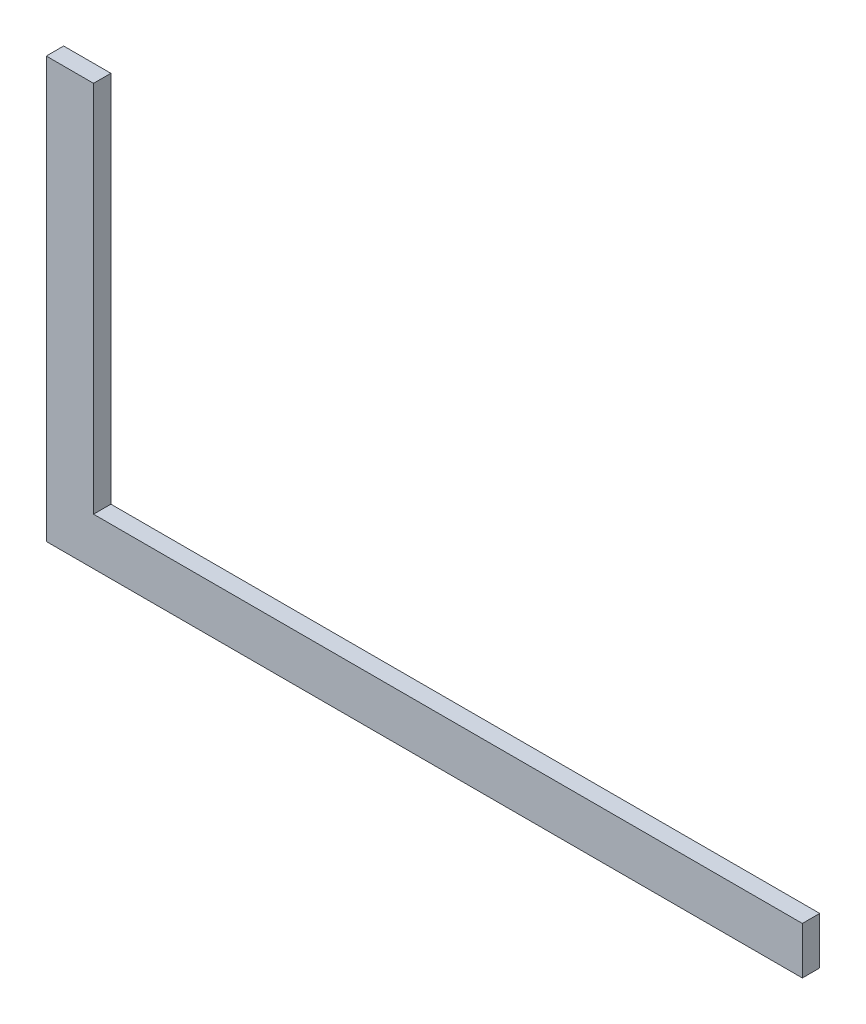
ISO-10303-21;
HEADER;
FILE_DESCRIPTION(('STEP AP214'),'2;1');
FILE_NAME('part.step','',(''),(''),'','','');
FILE_SCHEMA(('AUTOMOTIVE_DESIGN { 1 0 10303 214 1 1 1 1 }'));
ENDSEC;
DATA;
#1=APPLICATION_CONTEXT('core data for automotive mechanical design processes');
#2=APPLICATION_PROTOCOL_DEFINITION('international standard','automotive_design',2000,#1);
#3=PRODUCT_CONTEXT('',#1,'mechanical');
#4=PRODUCT('Part','Part','',(#3));
#5=PRODUCT_RELATED_PRODUCT_CATEGORY('part','',(#4));
#6=PRODUCT_DEFINITION_FORMATION('','',#4);
#7=PRODUCT_DEFINITION_CONTEXT('part definition',#1,'design');
#8=PRODUCT_DEFINITION('design','',#6,#7);
#9=PRODUCT_DEFINITION_SHAPE('','',#8);
#10=(LENGTH_UNIT() NAMED_UNIT(*) SI_UNIT(.MILLI.,.METRE.));
#11=(NAMED_UNIT(*) PLANE_ANGLE_UNIT() SI_UNIT($,.RADIAN.));
#12=(NAMED_UNIT(*) SI_UNIT($,.STERADIAN.) SOLID_ANGLE_UNIT());
#13=UNCERTAINTY_MEASURE_WITH_UNIT(LENGTH_MEASURE(1.E-05),#10,'distance_accuracy_value','');
#14=(GEOMETRIC_REPRESENTATION_CONTEXT(3) GLOBAL_UNCERTAINTY_ASSIGNED_CONTEXT((#13)) GLOBAL_UNIT_ASSIGNED_CONTEXT((#10,
#11,#12)) REPRESENTATION_CONTEXT('',''));
#15=CARTESIAN_POINT('',(0.,0.,0.));
#16=DIRECTION('',(0.,0.,1.));
#17=DIRECTION('',(1.,0.,0.));
#18=AXIS2_PLACEMENT_3D('',#15,#16,#17);
#19=CARTESIAN_POINT('',(0.,0.,1.4));
#20=DIRECTION('',(1.,0.,0.));
#21=DIRECTION('',(0.,0.,-1.));
#22=AXIS2_PLACEMENT_3D('',#19,#20,#21);
#23=PLANE('',#22);
#24=DIRECTION('',(0.,-1.,0.));
#25=VECTOR('',#24,1.);
#26=CARTESIAN_POINT('',(0.,0.,0.));
#27=LINE('',#26,#25);
#28=CARTESIAN_POINT('',(0.,33.8963,0.));
#29=VERTEX_POINT('',#28);
#30=CARTESIAN_POINT('',(0.,0.,0.));
#31=VERTEX_POINT('',#30);
#32=EDGE_CURVE('E117',#29,#31,#27,.T.);
#33=ORIENTED_EDGE('',*,*,#32,.T.);
#34=DIRECTION('',(0.,0.,-1.));
#35=VECTOR('',#34,1.);
#36=CARTESIAN_POINT('',(0.,0.,1.4));
#37=LINE('',#36,#35);
#38=CARTESIAN_POINT('',(0.,0.,1.4));
#39=VERTEX_POINT('',#38);
#40=EDGE_CURVE('E11',#39,#31,#37,.T.);
#41=ORIENTED_EDGE('',*,*,#40,.F.);
#42=DIRECTION('',(0.,-1.,0.));
#43=VECTOR('',#42,1.);
#44=CARTESIAN_POINT('',(0.,0.,1.4));
#45=LINE('',#44,#43);
#46=CARTESIAN_POINT('',(0.,33.8963,1.4));
#47=VERTEX_POINT('',#46);
#48=EDGE_CURVE('E127',#47,#39,#45,.T.);
#49=ORIENTED_EDGE('',*,*,#48,.F.);
#50=DIRECTION('',(0.,0.,-1.));
#51=VECTOR('',#50,1.);
#52=CARTESIAN_POINT('',(0.,33.8963,1.4));
#53=LINE('',#52,#51);
#54=EDGE_CURVE('E113',#47,#29,#53,.T.);
#55=ORIENTED_EDGE('',*,*,#54,.T.);
#56=EDGE_LOOP('',(#33,#41,#49,#55));
#57=FACE_BOUND('',#56,.T.);
#58=ADVANCED_FACE('F33',(#57),#23,.F.);
#59=CARTESIAN_POINT('',(0.,0.,1.4));
#60=DIRECTION('',(0.,1.,0.));
#61=DIRECTION('',(0.,0.,1.));
#62=AXIS2_PLACEMENT_3D('',#59,#60,#61);
#63=PLANE('',#62);
#64=DIRECTION('',(1.,0.,0.));
#65=VECTOR('',#64,1.);
#66=CARTESIAN_POINT('',(0.,0.,0.));
#67=LINE('',#66,#65);
#68=CARTESIAN_POINT('',(60.96,0.,0.));
#69=VERTEX_POINT('',#68);
#70=EDGE_CURVE('E120',#31,#69,#67,.T.);
#71=ORIENTED_EDGE('',*,*,#70,.T.);
#72=DIRECTION('',(0.,0.,-1.));
#73=VECTOR('',#72,1.);
#74=CARTESIAN_POINT('',(60.96,0.,1.4));
#75=LINE('',#74,#73);
#76=CARTESIAN_POINT('',(60.96,0.,1.4));
#77=VERTEX_POINT('',#76);
#78=EDGE_CURVE('E41',#77,#69,#75,.T.);
#79=ORIENTED_EDGE('',*,*,#78,.F.);
#80=DIRECTION('',(1.,0.,0.));
#81=VECTOR('',#80,1.);
#82=CARTESIAN_POINT('',(0.,0.,1.4));
#83=LINE('',#82,#81);
#84=EDGE_CURVE('E86',#39,#77,#83,.T.);
#85=ORIENTED_EDGE('',*,*,#84,.F.);
#86=ORIENTED_EDGE('',*,*,#40,.T.);
#87=EDGE_LOOP('',(#71,#79,#85,#86));
#88=FACE_BOUND('',#87,.T.);
#89=ADVANCED_FACE('F151',(#88),#63,.F.);
#90=CARTESIAN_POINT('',(60.96,0.,1.4));
#91=DIRECTION('',(-1.,0.,0.));
#92=DIRECTION('',(0.,0.,1.));
#93=AXIS2_PLACEMENT_3D('',#90,#91,#92);
#94=PLANE('',#93);
#95=DIRECTION('',(0.,1.,0.));
#96=VECTOR('',#95,1.);
#97=CARTESIAN_POINT('',(60.96,0.,0.));
#98=LINE('',#97,#96);
#99=CARTESIAN_POINT('',(60.96,3.81,0.));
#100=VERTEX_POINT('',#99);
#101=EDGE_CURVE('E122',#69,#100,#98,.T.);
#102=ORIENTED_EDGE('',*,*,#101,.T.);
#103=DIRECTION('',(0.,0.,-1.));
#104=VECTOR('',#103,1.);
#105=CARTESIAN_POINT('',(60.96,3.81,1.4));
#106=LINE('',#105,#104);
#107=CARTESIAN_POINT('',(60.96,3.81,1.4));
#108=VERTEX_POINT('',#107);
#109=EDGE_CURVE('E108',#108,#100,#106,.T.);
#110=ORIENTED_EDGE('',*,*,#109,.F.);
#111=DIRECTION('',(0.,1.,0.));
#112=VECTOR('',#111,1.);
#113=CARTESIAN_POINT('',(60.96,0.,1.4));
#114=LINE('',#113,#112);
#115=EDGE_CURVE('E99',#77,#108,#114,.T.);
#116=ORIENTED_EDGE('',*,*,#115,.F.);
#117=ORIENTED_EDGE('',*,*,#78,.T.);
#118=EDGE_LOOP('',(#102,#110,#116,#117));
#119=FACE_BOUND('',#118,.T.);
#120=ADVANCED_FACE('F133',(#119),#94,.F.);
#121=CARTESIAN_POINT('',(3.81,3.81,1.4));
#122=DIRECTION('',(0.,-1.,0.));
#123=DIRECTION('',(0.,0.,-1.));
#124=AXIS2_PLACEMENT_3D('',#121,#122,#123);
#125=PLANE('',#124);
#126=DIRECTION('',(-1.,0.,0.));
#127=VECTOR('',#126,1.);
#128=CARTESIAN_POINT('',(3.81,3.81,0.));
#129=LINE('',#128,#127);
#130=CARTESIAN_POINT('',(3.81,3.81,0.));
#131=VERTEX_POINT('',#130);
#132=EDGE_CURVE('E107',#100,#131,#129,.T.);
#133=ORIENTED_EDGE('',*,*,#132,.T.);
#134=DIRECTION('',(0.,0.,-1.));
#135=VECTOR('',#134,1.);
#136=CARTESIAN_POINT('',(3.81,3.81,1.4));
#137=LINE('',#136,#135);
#138=CARTESIAN_POINT('',(3.81,3.81,1.4));
#139=VERTEX_POINT('',#138);
#140=EDGE_CURVE('E104',#139,#131,#137,.T.);
#141=ORIENTED_EDGE('',*,*,#140,.F.);
#142=DIRECTION('',(-1.,0.,0.));
#143=VECTOR('',#142,1.);
#144=CARTESIAN_POINT('',(3.81,3.81,1.4));
#145=LINE('',#144,#143);
#146=EDGE_CURVE('E93',#108,#139,#145,.T.);
#147=ORIENTED_EDGE('',*,*,#146,.F.);
#148=ORIENTED_EDGE('',*,*,#109,.T.);
#149=EDGE_LOOP('',(#133,#141,#147,#148));
#150=FACE_BOUND('',#149,.T.);
#151=ADVANCED_FACE('F105',(#150),#125,.F.);
#152=CARTESIAN_POINT('',(3.81,3.81,1.4));
#153=DIRECTION('',(-1.,0.,0.));
#154=DIRECTION('',(0.,0.,1.));
#155=AXIS2_PLACEMENT_3D('',#152,#153,#154);
#156=PLANE('',#155);
#157=DIRECTION('',(0.,1.,0.));
#158=VECTOR('',#157,1.);
#159=CARTESIAN_POINT('',(3.81,3.81,0.));
#160=LINE('',#159,#158);
#161=CARTESIAN_POINT('',(3.81,33.8963,0.));
#162=VERTEX_POINT('',#161);
#163=EDGE_CURVE('E72',#131,#162,#160,.T.);
#164=ORIENTED_EDGE('',*,*,#163,.T.);
#165=DIRECTION('',(0.,0.,-1.));
#166=VECTOR('',#165,1.);
#167=CARTESIAN_POINT('',(3.81,33.8963,1.4));
#168=LINE('',#167,#166);
#169=CARTESIAN_POINT('',(3.81,33.8963,1.4));
#170=VERTEX_POINT('',#169);
#171=EDGE_CURVE('E109',#170,#162,#168,.T.);
#172=ORIENTED_EDGE('',*,*,#171,.F.);
#173=DIRECTION('',(0.,1.,0.));
#174=VECTOR('',#173,1.);
#175=CARTESIAN_POINT('',(3.81,3.81,1.4));
#176=LINE('',#175,#174);
#177=EDGE_CURVE('E97',#139,#170,#176,.T.);
#178=ORIENTED_EDGE('',*,*,#177,.F.);
#179=ORIENTED_EDGE('',*,*,#140,.T.);
#180=EDGE_LOOP('',(#164,#172,#178,#179));
#181=FACE_BOUND('',#180,.T.);
#182=ADVANCED_FACE('F111',(#181),#156,.F.);
#183=CARTESIAN_POINT('',(0.,33.8963,1.4));
#184=DIRECTION('',(0.,-1.,0.));
#185=DIRECTION('',(0.,0.,-1.));
#186=AXIS2_PLACEMENT_3D('',#183,#184,#185);
#187=PLANE('',#186);
#188=DIRECTION('',(-1.,0.,0.));
#189=VECTOR('',#188,1.);
#190=CARTESIAN_POINT('',(0.,33.8963,0.));
#191=LINE('',#190,#189);
#192=EDGE_CURVE('E78',#162,#29,#191,.T.);
#193=ORIENTED_EDGE('',*,*,#192,.T.);
#194=ORIENTED_EDGE('',*,*,#54,.F.);
#195=DIRECTION('',(-1.,0.,0.));
#196=VECTOR('',#195,1.);
#197=CARTESIAN_POINT('',(0.,33.8963,1.4));
#198=LINE('',#197,#196);
#199=EDGE_CURVE('E49',#170,#47,#198,.T.);
#200=ORIENTED_EDGE('',*,*,#199,.F.);
#201=ORIENTED_EDGE('',*,*,#171,.T.);
#202=EDGE_LOOP('',(#193,#194,#200,#201));
#203=FACE_BOUND('',#202,.T.);
#204=ADVANCED_FACE('F140',(#203),#187,.F.);
#205=CARTESIAN_POINT('',(0.,0.,1.4));
#206=DIRECTION('',(0.,0.,-1.));
#207=DIRECTION('',(-1.,0.,0.));
#208=AXIS2_PLACEMENT_3D('',#205,#206,#207);
#209=PLANE('',#208);
#210=ORIENTED_EDGE('',*,*,#48,.T.);
#211=ORIENTED_EDGE('',*,*,#84,.T.);
#212=ORIENTED_EDGE('',*,*,#115,.T.);
#213=ORIENTED_EDGE('',*,*,#146,.T.);
#214=ORIENTED_EDGE('',*,*,#177,.T.);
#215=ORIENTED_EDGE('',*,*,#199,.T.);
#216=EDGE_LOOP('',(#210,#211,#212,#213,#214,#215));
#217=FACE_BOUND('',#216,.T.);
#218=ADVANCED_FACE('F95',(#217),#209,.F.);
#219=CARTESIAN_POINT('',(0.,0.,0.));
#220=DIRECTION('',(0.,0.,-1.));
#221=DIRECTION('',(-1.,0.,0.));
#222=AXIS2_PLACEMENT_3D('',#219,#220,#221);
#223=PLANE('',#222);
#224=ORIENTED_EDGE('',*,*,#32,.F.);
#225=ORIENTED_EDGE('',*,*,#192,.F.);
#226=ORIENTED_EDGE('',*,*,#163,.F.);
#227=ORIENTED_EDGE('',*,*,#132,.F.);
#228=ORIENTED_EDGE('',*,*,#101,.F.);
#229=ORIENTED_EDGE('',*,*,#70,.F.);
#230=EDGE_LOOP('',(#224,#225,#226,#227,#228,#229));
#231=FACE_BOUND('',#230,.T.);
#232=ADVANCED_FACE('F136',(#231),#223,.T.);
#233=CLOSED_SHELL('',(#58,#89,#120,#151,#182,#204,#218,#232));
#234=MANIFOLD_SOLID_BREP('B2',#233);
#235=ADVANCED_BREP_SHAPE_REPRESENTATION('',(#18,#234),#14);
#236=SHAPE_DEFINITION_REPRESENTATION(#9,#235);
ENDSEC;
END-ISO-10303-21;
